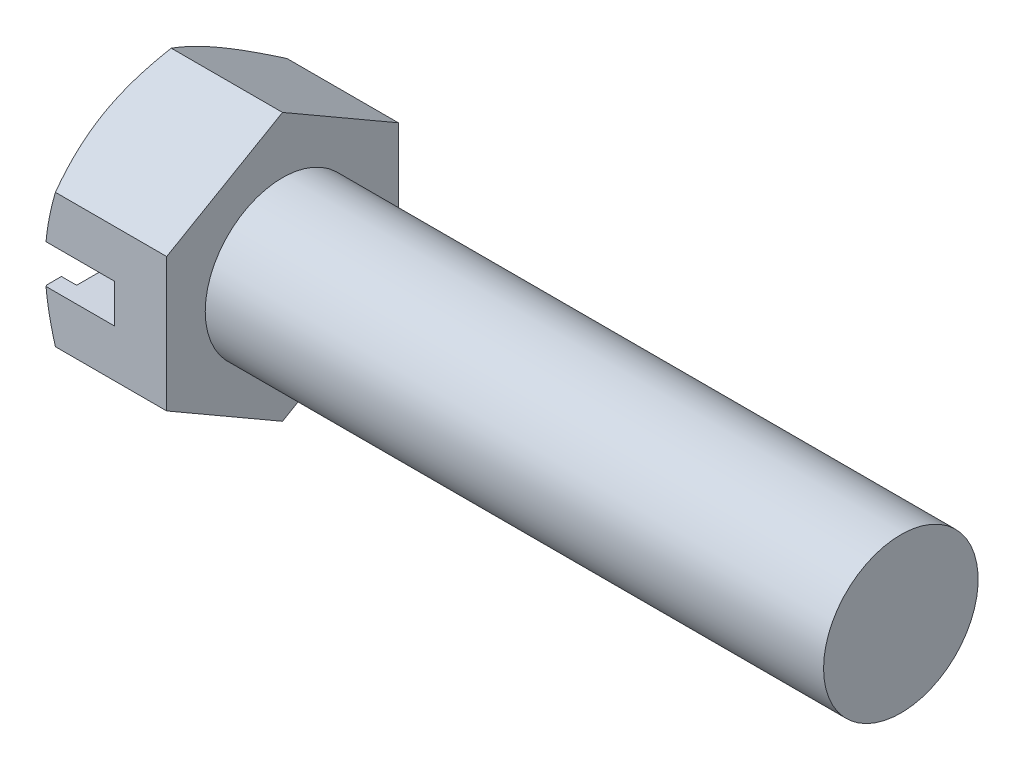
from build123d import *

# Parameters (mm, degrees)
HEX_DIE_START = -2e-06
SKETCH2_R     = 8.3242194
HEX_DIE_DEPTH = 7.493002
SKETCH3_W     = 16.483602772
SKETCH3_H     = 2.3876
SLOT_DEPTH    = 4.2672
SKETCH4_R     = 6.245225
INDENT_DEPTH  = 0.936625


with BuildPart() as part:
    # BodySke → Base-Revolve (revolve)
    with BuildSketch(Plane.XY, mode=Mode.PRIVATE) as base_revolve_sk:
        Polygon((7.493, 4.7625), (7.493, 8.241801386), (0.637626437, 8.241801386), (0, 7.1374), (0, 0), (45.593, 0), (45.593, 4.7625), align=None)
    revolve(base_revolve_sk.sketch.rotate(Axis((-25.4, 0, 0), (1, 0, 0)), 90), axis=Axis((-25.4, 0, 0), (1, 0, 0)))

    # Sketch2 → Hex-Die (cut)
    with BuildSketch(Plane(origin=(0, 0, 0), x_dir=(0, 0, -1), z_dir=(1, 0, 0)).offset(HEX_DIE_START)):
        Circle(SKETCH2_R)
        Polygon((-7.1374, 4.120779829), (0, 8.241559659), (7.1374, 4.120779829), (7.1374, -4.120779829), (0, -8.241559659), (-7.1374, -4.120779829), align=None, mode=Mode.SUBTRACT)
    extrude(amount=HEX_DIE_DEPTH, mode=Mode.SUBTRACT)

    # Sketch3 → Slot (cut)
    with BuildSketch(Plane(origin=(0, 0, 0), x_dir=(0, 0, -1), z_dir=(1, 0, 0))):
        Rectangle(SKETCH3_W, SKETCH3_H)
    extrude(amount=SLOT_DEPTH, mode=Mode.SUBTRACT)

    # Sketch4 → Indent (cut)
    with BuildSketch(Plane(origin=(0, 0, 0), x_dir=(0, 0, -1), z_dir=(1, 0, 0))):
        Circle(SKETCH4_R)
    extrude(amount=INDENT_DEPTH, mode=Mode.SUBTRACT)


solid = part.part
